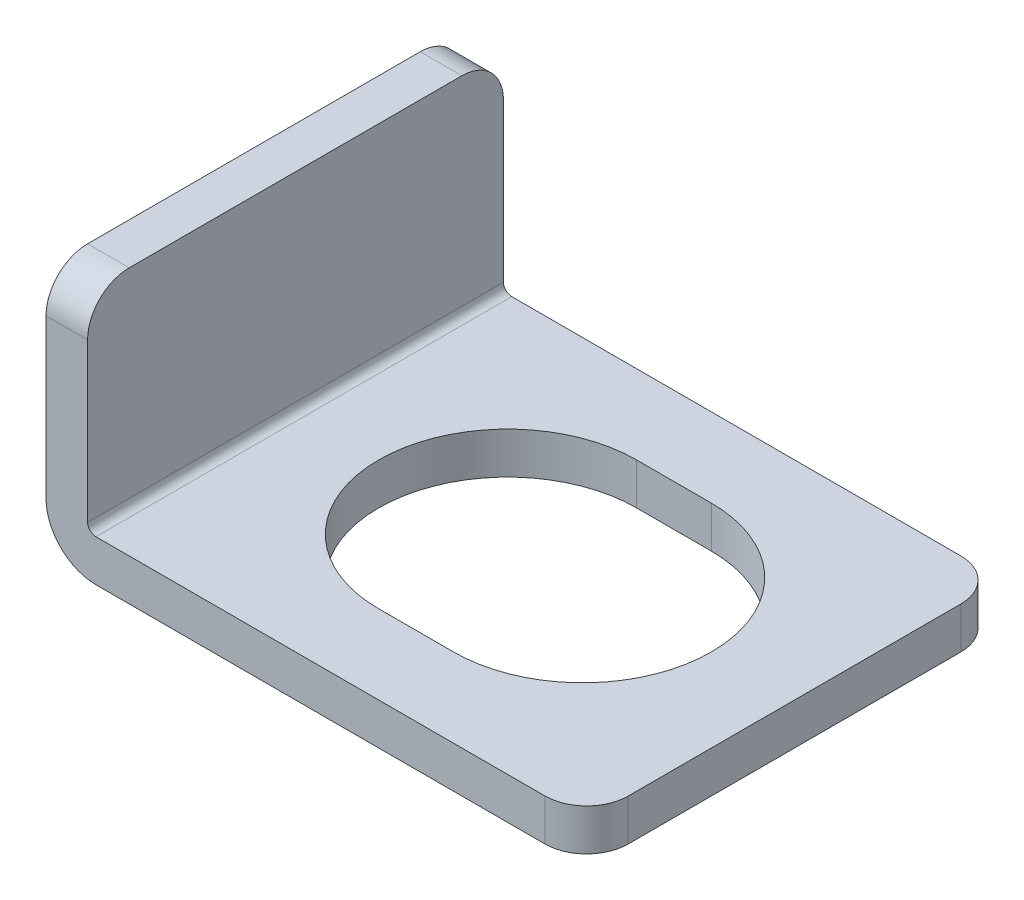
from build123d import *

# Parameters (mm, degrees)
BOSS_EXTRUDE1_DEPTH = 5
CUT_EXTRUDE1_DEPTH  = 15.798648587
FILLET1_R           = 1


with BuildPart() as part:
    # Sketch1 → Boss-Extrude1 (new, symmetric)
    with BuildSketch(Plane.XY):
        with BuildLine():
            Line((0, 1.2), (0, 6))
            Line((0, 6), (1, 6))
            Line((1, 6), (1, 1.2))
            ThreePointArc((1, 1.2), (1.058578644, 1.058578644), (1.2, 1))
            Line((1.2, 1), (13, 1))
            Line((13, 1), (13, 0))
            Line((13, 0), (1.2, 0))
            ThreePointArc((1.2, 0), (0.351471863, 0.351471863), (0, 1.2))
        make_face()
    extrude(amount=BOSS_EXTRUDE1_DEPTH, both=True)

    # Sketch2 → Cut-Extrude1 (cut, through all)
    with BuildSketch(Plane(origin=(0, 1, 0), x_dir=(1, 0, 0), z_dir=(0, 1, 0))):
        with BuildLine():
            Line((6.1, 3.1), (7.9, 3.1))
            ThreePointArc((7.9, 3.1), (11, 0), (7.9, -3.1))
            Line((7.9, -3.1), (6.1, -3.1))
            ThreePointArc((6.1, -3.1), (3, 0), (6.1, 3.1))
        make_face()
    extrude(amount=-CUT_EXTRUDE1_DEPTH, mode=Mode.SUBTRACT)

    # Fillet1
    fillet1_edges = [part.edges().sort_by_distance(p)[0] for p in [
        (0.5, 6, -5),
        (13, 0.5, 5),
        (0.5, 6, 5),
        (13, 0.5, -5),
    ]]
    fillet(fillet1_edges, radius=FILLET1_R)


solid = part.part
